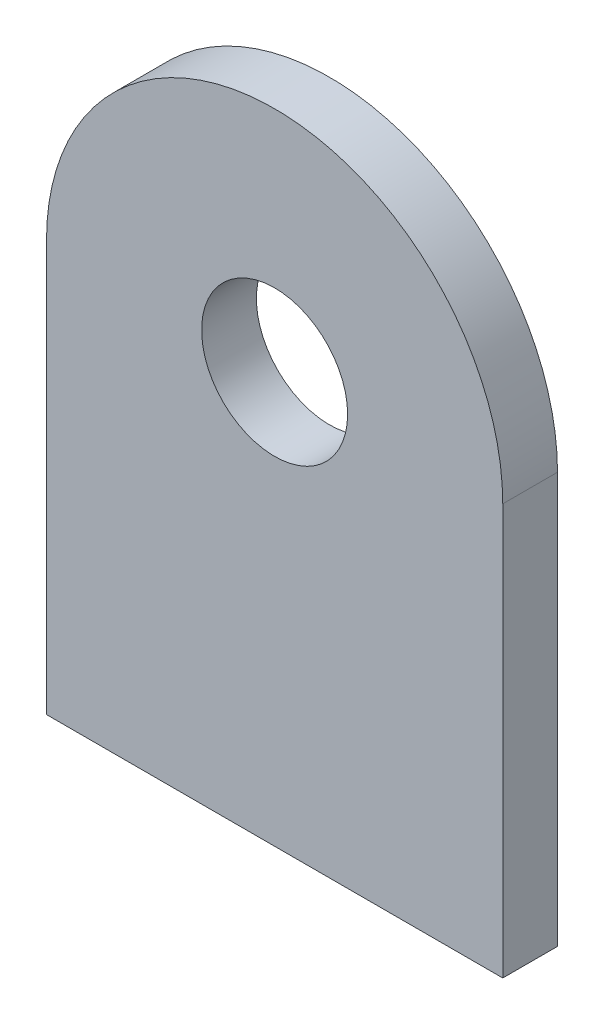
ISO-10303-21;
HEADER;
FILE_DESCRIPTION(('STEP AP214'),'2;1');
FILE_NAME('part.step','',(''),(''),'','','');
FILE_SCHEMA(('AUTOMOTIVE_DESIGN { 1 0 10303 214 1 1 1 1 }'));
ENDSEC;
DATA;
#1=APPLICATION_CONTEXT('core data for automotive mechanical design processes');
#2=APPLICATION_PROTOCOL_DEFINITION('international standard','automotive_design',2000,#1);
#3=PRODUCT_CONTEXT('',#1,'mechanical');
#4=PRODUCT('Part','Part','',(#3));
#5=PRODUCT_RELATED_PRODUCT_CATEGORY('part','',(#4));
#6=PRODUCT_DEFINITION_FORMATION('','',#4);
#7=PRODUCT_DEFINITION_CONTEXT('part definition',#1,'design');
#8=PRODUCT_DEFINITION('design','',#6,#7);
#9=PRODUCT_DEFINITION_SHAPE('','',#8);
#10=(LENGTH_UNIT() NAMED_UNIT(*) SI_UNIT(.MILLI.,.METRE.));
#11=(NAMED_UNIT(*) PLANE_ANGLE_UNIT() SI_UNIT($,.RADIAN.));
#12=(NAMED_UNIT(*) SI_UNIT($,.STERADIAN.) SOLID_ANGLE_UNIT());
#13=UNCERTAINTY_MEASURE_WITH_UNIT(LENGTH_MEASURE(1.E-05),#10,'distance_accuracy_value','');
#14=(GEOMETRIC_REPRESENTATION_CONTEXT(3) GLOBAL_UNCERTAINTY_ASSIGNED_CONTEXT((#13)) GLOBAL_UNIT_ASSIGNED_CONTEXT((#10,
#11,#12)) REPRESENTATION_CONTEXT('',''));
#15=CARTESIAN_POINT('',(0.,0.,0.));
#16=DIRECTION('',(0.,0.,1.));
#17=DIRECTION('',(1.,0.,0.));
#18=AXIS2_PLACEMENT_3D('',#15,#16,#17);
#19=CARTESIAN_POINT('',(-12.5,22.5,3.));
#20=DIRECTION('',(1.,0.,0.));
#21=DIRECTION('',(0.,1.,0.));
#22=AXIS2_PLACEMENT_3D('',#19,#20,#21);
#23=PLANE('',#22);
#24=DIRECTION('',(0.,-1.,0.));
#25=VECTOR('',#24,1.);
#26=CARTESIAN_POINT('',(-12.5,22.5,0.));
#27=LINE('',#26,#25);
#28=CARTESIAN_POINT('',(-12.5,22.5,0.));
#29=VERTEX_POINT('',#28);
#30=CARTESIAN_POINT('',(-12.5,0.,0.));
#31=VERTEX_POINT('',#30);
#32=EDGE_CURVE('E95',#29,#31,#27,.T.);
#33=ORIENTED_EDGE('',*,*,#32,.T.);
#34=DIRECTION('',(0.,0.,-1.));
#35=VECTOR('',#34,1.);
#36=CARTESIAN_POINT('',(-12.5,0.,3.));
#37=LINE('',#36,#35);
#38=CARTESIAN_POINT('',(-12.5,0.,3.));
#39=VERTEX_POINT('',#38);
#40=EDGE_CURVE('E11',#39,#31,#37,.T.);
#41=ORIENTED_EDGE('',*,*,#40,.F.);
#42=DIRECTION('',(0.,-1.,0.));
#43=VECTOR('',#42,1.);
#44=CARTESIAN_POINT('',(-12.5,22.5,3.));
#45=LINE('',#44,#43);
#46=CARTESIAN_POINT('',(-12.5,22.5,3.));
#47=VERTEX_POINT('',#46);
#48=EDGE_CURVE('E83',#47,#39,#45,.T.);
#49=ORIENTED_EDGE('',*,*,#48,.F.);
#50=DIRECTION('',(0.,0.,-1.));
#51=VECTOR('',#50,1.);
#52=CARTESIAN_POINT('',(-12.5,22.5,3.));
#53=LINE('',#52,#51);
#54=EDGE_CURVE('E91',#47,#29,#53,.T.);
#55=ORIENTED_EDGE('',*,*,#54,.T.);
#56=EDGE_LOOP('',(#33,#41,#49,#55));
#57=FACE_BOUND('',#56,.T.);
#58=ADVANCED_FACE('F32',(#57),#23,.F.);
#59=CARTESIAN_POINT('',(-12.5,0.,3.));
#60=DIRECTION('',(0.,1.,0.));
#61=DIRECTION('',(-1.,0.,0.));
#62=AXIS2_PLACEMENT_3D('',#59,#60,#61);
#63=PLANE('',#62);
#64=DIRECTION('',(1.,0.,0.));
#65=VECTOR('',#64,1.);
#66=CARTESIAN_POINT('',(-12.5,0.,0.));
#67=LINE('',#66,#65);
#68=CARTESIAN_POINT('',(12.5,0.,0.));
#69=VERTEX_POINT('',#68);
#70=EDGE_CURVE('E87',#31,#69,#67,.T.);
#71=ORIENTED_EDGE('',*,*,#70,.T.);
#72=DIRECTION('',(0.,0.,-1.));
#73=VECTOR('',#72,1.);
#74=CARTESIAN_POINT('',(12.5,0.,3.));
#75=LINE('',#74,#73);
#76=CARTESIAN_POINT('',(12.5,0.,3.));
#77=VERTEX_POINT('',#76);
#78=EDGE_CURVE('E40',#77,#69,#75,.T.);
#79=ORIENTED_EDGE('',*,*,#78,.F.);
#80=DIRECTION('',(1.,0.,0.));
#81=VECTOR('',#80,1.);
#82=CARTESIAN_POINT('',(-12.5,0.,3.));
#83=LINE('',#82,#81);
#84=EDGE_CURVE('E78',#39,#77,#83,.T.);
#85=ORIENTED_EDGE('',*,*,#84,.F.);
#86=ORIENTED_EDGE('',*,*,#40,.T.);
#87=EDGE_LOOP('',(#71,#79,#85,#86));
#88=FACE_BOUND('',#87,.T.);
#89=ADVANCED_FACE('F86',(#88),#63,.F.);
#90=CARTESIAN_POINT('',(12.5,0.,3.));
#91=DIRECTION('',(-1.,0.,0.));
#92=DIRECTION('',(0.,-1.,0.));
#93=AXIS2_PLACEMENT_3D('',#90,#91,#92);
#94=PLANE('',#93);
#95=DIRECTION('',(0.,1.,0.));
#96=VECTOR('',#95,1.);
#97=CARTESIAN_POINT('',(12.5,0.,0.));
#98=LINE('',#97,#96);
#99=CARTESIAN_POINT('',(12.5,22.5,0.));
#100=VERTEX_POINT('',#99);
#101=EDGE_CURVE('E65',#69,#100,#98,.T.);
#102=ORIENTED_EDGE('',*,*,#101,.T.);
#103=DIRECTION('',(0.,0.,-1.));
#104=VECTOR('',#103,1.);
#105=CARTESIAN_POINT('',(12.5,22.5,3.));
#106=LINE('',#105,#104);
#107=CARTESIAN_POINT('',(12.5,22.5,3.));
#108=VERTEX_POINT('',#107);
#109=EDGE_CURVE('E88',#108,#100,#106,.T.);
#110=ORIENTED_EDGE('',*,*,#109,.F.);
#111=DIRECTION('',(0.,1.,0.));
#112=VECTOR('',#111,1.);
#113=CARTESIAN_POINT('',(12.5,0.,3.));
#114=LINE('',#113,#112);
#115=EDGE_CURVE('E81',#77,#108,#114,.T.);
#116=ORIENTED_EDGE('',*,*,#115,.F.);
#117=ORIENTED_EDGE('',*,*,#78,.T.);
#118=EDGE_LOOP('',(#102,#110,#116,#117));
#119=FACE_BOUND('',#118,.T.);
#120=ADVANCED_FACE('F89',(#119),#94,.F.);
#121=CARTESIAN_POINT('',(0.,22.5,3.));
#122=DIRECTION('',(0.,0.,-1.));
#123=DIRECTION('',(-1.,0.,0.));
#124=AXIS2_PLACEMENT_3D('',#121,#122,#123);
#125=CYLINDRICAL_SURFACE('',#124,12.5);
#126=CARTESIAN_POINT('',(0.,22.5,0.));
#127=DIRECTION('',(0.,0.,1.));
#128=DIRECTION('',(1.,0.,0.));
#129=AXIS2_PLACEMENT_3D('',#126,#127,#128);
#130=CIRCLE('',#129,12.5);
#131=EDGE_CURVE('E71',#100,#29,#130,.T.);
#132=ORIENTED_EDGE('',*,*,#131,.T.);
#133=ORIENTED_EDGE('',*,*,#54,.F.);
#134=CARTESIAN_POINT('',(0.,22.5,3.));
#135=DIRECTION('',(0.,0.,1.));
#136=DIRECTION('',(1.,0.,0.));
#137=AXIS2_PLACEMENT_3D('',#134,#135,#136);
#138=CIRCLE('',#137,12.5);
#139=EDGE_CURVE('E48',#108,#47,#138,.T.);
#140=ORIENTED_EDGE('',*,*,#139,.F.);
#141=ORIENTED_EDGE('',*,*,#109,.T.);
#142=EDGE_LOOP('',(#132,#133,#140,#141));
#143=FACE_BOUND('',#142,.T.);
#144=ADVANCED_FACE('F103',(#143),#125,.T.);
#145=CARTESIAN_POINT('',(0.,22.5,3.));
#146=DIRECTION('',(0.,0.,1.));
#147=DIRECTION('',(1.,0.,0.));
#148=AXIS2_PLACEMENT_3D('',#145,#146,#147);
#149=PLANE('',#148);
#150=CARTESIAN_POINT('',(0.,22.5,3.));
#151=DIRECTION('',(0.,0.,1.));
#152=DIRECTION('',(1.,0.,0.));
#153=AXIS2_PLACEMENT_3D('',#150,#151,#152);
#154=CIRCLE('',#153,4.);
#155=CARTESIAN_POINT('',(4.,22.5,3.));
#156=VERTEX_POINT('',#155);
#157=EDGE_CURVE('E109',#156,#156,#154,.T.);
#158=ORIENTED_EDGE('',*,*,#157,.F.);
#159=EDGE_LOOP('',(#158));
#160=FACE_BOUND('',#159,.T.);
#161=ORIENTED_EDGE('',*,*,#48,.T.);
#162=ORIENTED_EDGE('',*,*,#84,.T.);
#163=ORIENTED_EDGE('',*,*,#115,.T.);
#164=ORIENTED_EDGE('',*,*,#139,.T.);
#165=EDGE_LOOP('',(#161,#162,#163,#164));
#166=FACE_BOUND('',#165,.T.);
#167=ADVANCED_FACE('F79',(#160,#166),#149,.T.);
#168=CARTESIAN_POINT('',(0.,22.5,0.));
#169=DIRECTION('',(0.,0.,1.));
#170=DIRECTION('',(1.,0.,0.));
#171=AXIS2_PLACEMENT_3D('',#168,#169,#170);
#172=PLANE('',#171);
#173=CARTESIAN_POINT('',(0.,22.5,0.));
#174=DIRECTION('',(0.,0.,1.));
#175=DIRECTION('',(1.,0.,0.));
#176=AXIS2_PLACEMENT_3D('',#173,#174,#175);
#177=CIRCLE('',#176,4.);
#178=CARTESIAN_POINT('',(4.,22.5,0.));
#179=VERTEX_POINT('',#178);
#180=EDGE_CURVE('E98',#179,#179,#177,.T.);
#181=ORIENTED_EDGE('',*,*,#180,.T.);
#182=EDGE_LOOP('',(#181));
#183=FACE_BOUND('',#182,.T.);
#184=ORIENTED_EDGE('',*,*,#32,.F.);
#185=ORIENTED_EDGE('',*,*,#131,.F.);
#186=ORIENTED_EDGE('',*,*,#101,.F.);
#187=ORIENTED_EDGE('',*,*,#70,.F.);
#188=EDGE_LOOP('',(#184,#185,#186,#187));
#189=FACE_BOUND('',#188,.T.);
#190=ADVANCED_FACE('F106',(#183,#189),#172,.F.);
#191=CARTESIAN_POINT('',(0.,22.5,0.));
#192=DIRECTION('',(0.,0.,1.));
#193=DIRECTION('',(1.,0.,0.));
#194=AXIS2_PLACEMENT_3D('',#191,#192,#193);
#195=CYLINDRICAL_SURFACE('',#194,4.);
#196=ORIENTED_EDGE('',*,*,#180,.F.);
#197=EDGE_LOOP('',(#196));
#198=FACE_BOUND('',#197,.T.);
#199=ORIENTED_EDGE('',*,*,#157,.T.);
#200=EDGE_LOOP('',(#199));
#201=FACE_BOUND('',#200,.T.);
#202=ADVANCED_FACE('F116',(#198,#201),#195,.F.);
#203=CLOSED_SHELL('',(#58,#89,#120,#144,#167,#190,#202));
#204=MANIFOLD_SOLID_BREP('B2',#203);
#205=ADVANCED_BREP_SHAPE_REPRESENTATION('',(#18,#204),#14);
#206=SHAPE_DEFINITION_REPRESENTATION(#9,#205);
ENDSEC;
END-ISO-10303-21;
